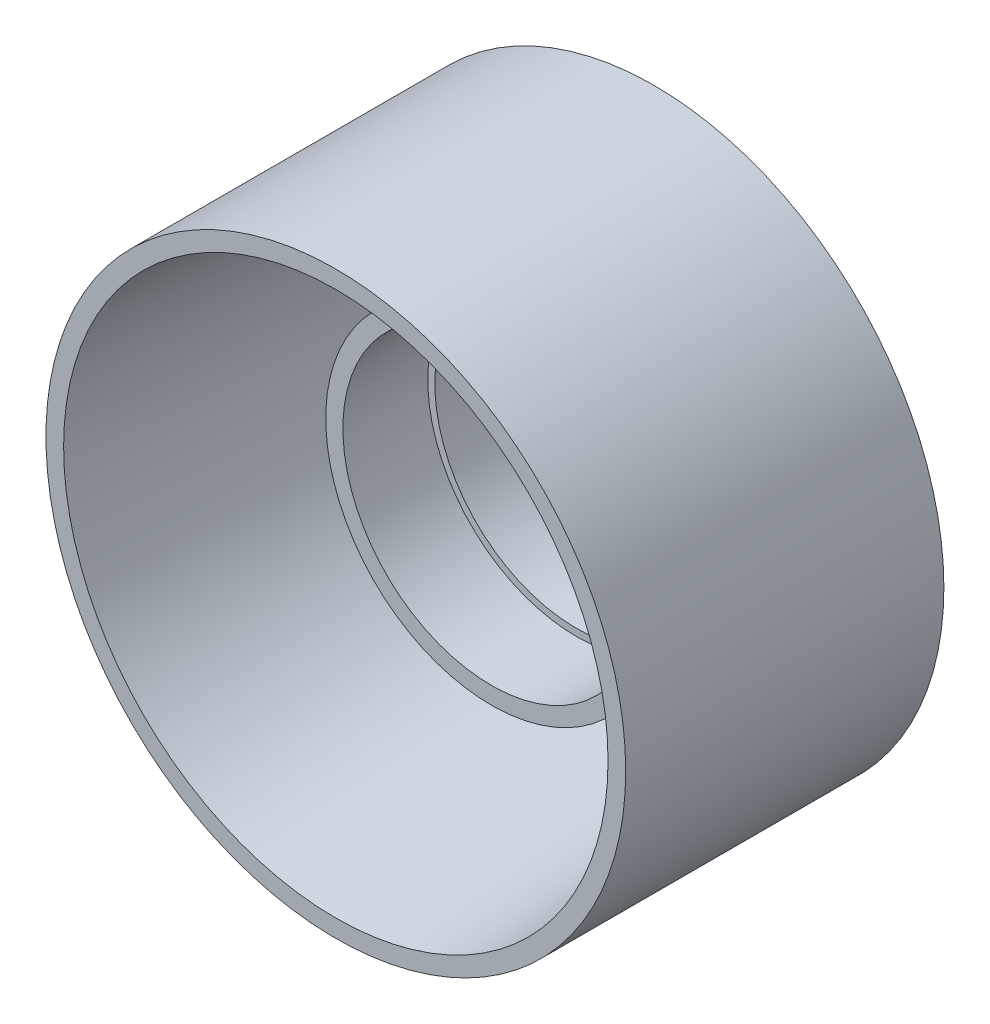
ISO-10303-21;
HEADER;
FILE_DESCRIPTION(('STEP AP214'),'2;1');
FILE_NAME('part.step','',(''),(''),'','','');
FILE_SCHEMA(('AUTOMOTIVE_DESIGN { 1 0 10303 214 1 1 1 1 }'));
ENDSEC;
DATA;
#1=APPLICATION_CONTEXT('core data for automotive mechanical design processes');
#2=APPLICATION_PROTOCOL_DEFINITION('international standard','automotive_design',2000,#1);
#3=PRODUCT_CONTEXT('',#1,'mechanical');
#4=PRODUCT('Part','Part','',(#3));
#5=PRODUCT_RELATED_PRODUCT_CATEGORY('part','',(#4));
#6=PRODUCT_DEFINITION_FORMATION('','',#4);
#7=PRODUCT_DEFINITION_CONTEXT('part definition',#1,'design');
#8=PRODUCT_DEFINITION('design','',#6,#7);
#9=PRODUCT_DEFINITION_SHAPE('','',#8);
#10=(LENGTH_UNIT() NAMED_UNIT(*) SI_UNIT(.MILLI.,.METRE.));
#11=(NAMED_UNIT(*) PLANE_ANGLE_UNIT() SI_UNIT($,.RADIAN.));
#12=(NAMED_UNIT(*) SI_UNIT($,.STERADIAN.) SOLID_ANGLE_UNIT());
#13=UNCERTAINTY_MEASURE_WITH_UNIT(LENGTH_MEASURE(1.E-05),#10,'distance_accuracy_value','');
#14=(GEOMETRIC_REPRESENTATION_CONTEXT(3) GLOBAL_UNCERTAINTY_ASSIGNED_CONTEXT((#13)) GLOBAL_UNIT_ASSIGNED_CONTEXT((#10,
#11,#12)) REPRESENTATION_CONTEXT('',''));
#15=CARTESIAN_POINT('',(0.,0.,0.));
#16=DIRECTION('',(0.,0.,1.));
#17=DIRECTION('',(1.,0.,0.));
#18=AXIS2_PLACEMENT_3D('',#15,#16,#17);
#19=CARTESIAN_POINT('',(0.,0.,5.));
#20=DIRECTION('',(0.,0.,1.));
#21=DIRECTION('',(1.,0.,0.));
#22=AXIS2_PLACEMENT_3D('',#19,#20,#21);
#23=PLANE('',#22);
#24=CARTESIAN_POINT('',(0.,0.,5.));
#25=DIRECTION('',(0.,0.,1.));
#26=DIRECTION('',(1.,0.,0.));
#27=AXIS2_PLACEMENT_3D('',#24,#25,#26);
#28=CIRCLE('',#27,35.0004534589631);
#29=CARTESIAN_POINT('',(35.0004534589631,0.,5.));
#30=VERTEX_POINT('',#29);
#31=EDGE_CURVE('E26',#30,#30,#28,.T.);
#32=ORIENTED_EDGE('',*,*,#31,.T.);
#33=EDGE_LOOP('',(#32));
#34=FACE_BOUND('',#33,.T.);
#35=CARTESIAN_POINT('',(0.,0.,5.));
#36=DIRECTION('',(0.,0.,1.));
#37=DIRECTION('',(1.,0.,0.));
#38=AXIS2_PLACEMENT_3D('',#35,#36,#37);
#39=CIRCLE('',#38,25.);
#40=CARTESIAN_POINT('',(25.,0.,5.));
#41=VERTEX_POINT('',#40);
#42=EDGE_CURVE('E38',#41,#41,#39,.T.);
#43=ORIENTED_EDGE('',*,*,#42,.F.);
#44=EDGE_LOOP('',(#43));
#45=FACE_BOUND('',#44,.T.);
#46=ADVANCED_FACE('F15',(#34,#45),#23,.T.);
#47=CARTESIAN_POINT('',(0.,0.,45.));
#48=DIRECTION('',(0.,0.,-1.));
#49=DIRECTION('',(-1.,0.,0.));
#50=AXIS2_PLACEMENT_3D('',#47,#48,#49);
#51=CYLINDRICAL_SURFACE('',#50,41.);
#52=CARTESIAN_POINT('',(0.,0.,45.));
#53=DIRECTION('',(0.,0.,1.));
#54=DIRECTION('',(1.,0.,0.));
#55=AXIS2_PLACEMENT_3D('',#52,#53,#54);
#56=CIRCLE('',#55,41.);
#57=CARTESIAN_POINT('',(41.,0.,45.));
#58=VERTEX_POINT('',#57);
#59=EDGE_CURVE('E10',#58,#58,#56,.T.);
#60=ORIENTED_EDGE('',*,*,#59,.F.);
#61=EDGE_LOOP('',(#60));
#62=FACE_BOUND('',#61,.T.);
#63=CARTESIAN_POINT('',(0.,0.,0.));
#64=DIRECTION('',(0.,0.,1.));
#65=DIRECTION('',(1.,0.,0.));
#66=AXIS2_PLACEMENT_3D('',#63,#64,#65);
#67=CIRCLE('',#66,41.);
#68=CARTESIAN_POINT('',(41.,0.,0.));
#69=VERTEX_POINT('',#68);
#70=EDGE_CURVE('E22',#69,#69,#67,.T.);
#71=ORIENTED_EDGE('',*,*,#70,.T.);
#72=EDGE_LOOP('',(#71));
#73=FACE_BOUND('',#72,.T.);
#74=ADVANCED_FACE('F17',(#62,#73),#51,.T.);
#75=CARTESIAN_POINT('',(0.,0.,45.));
#76=DIRECTION('',(0.,0.,1.));
#77=DIRECTION('',(1.,0.,0.));
#78=AXIS2_PLACEMENT_3D('',#75,#76,#77);
#79=PLANE('',#78);
#80=CARTESIAN_POINT('',(0.,0.,45.));
#81=DIRECTION('',(0.,0.,1.));
#82=DIRECTION('',(1.,0.,0.));
#83=AXIS2_PLACEMENT_3D('',#80,#81,#82);
#84=CIRCLE('',#83,38.5);
#85=CARTESIAN_POINT('',(38.5,0.,45.));
#86=VERTEX_POINT('',#85);
#87=EDGE_CURVE('E30',#86,#86,#84,.T.);
#88=ORIENTED_EDGE('',*,*,#87,.F.);
#89=EDGE_LOOP('',(#88));
#90=FACE_BOUND('',#89,.T.);
#91=ORIENTED_EDGE('',*,*,#59,.T.);
#92=EDGE_LOOP('',(#91));
#93=FACE_BOUND('',#92,.T.);
#94=ADVANCED_FACE('F106',(#90,#93),#79,.T.);
#95=CARTESIAN_POINT('',(0.,0.,0.));
#96=DIRECTION('',(0.,0.,1.));
#97=DIRECTION('',(1.,0.,0.));
#98=AXIS2_PLACEMENT_3D('',#95,#96,#97);
#99=PLANE('',#98);
#100=CARTESIAN_POINT('',(0.,0.,0.));
#101=DIRECTION('',(0.,0.,1.));
#102=DIRECTION('',(1.,0.,0.));
#103=AXIS2_PLACEMENT_3D('',#100,#101,#102);
#104=CIRCLE('',#103,15.5);
#105=CARTESIAN_POINT('',(15.5,0.,0.));
#106=VERTEX_POINT('',#105);
#107=EDGE_CURVE('E53',#106,#106,#104,.T.);
#108=ORIENTED_EDGE('',*,*,#107,.T.);
#109=EDGE_LOOP('',(#108));
#110=FACE_BOUND('',#109,.T.);
#111=ORIENTED_EDGE('',*,*,#70,.F.);
#112=EDGE_LOOP('',(#111));
#113=FACE_BOUND('',#112,.T.);
#114=ADVANCED_FACE('F111',(#110,#113),#99,.F.);
#115=CARTESIAN_POINT('',(0.,0.,45.));
#116=DIRECTION('',(0.,0.,1.));
#117=DIRECTION('',(1.,0.,0.));
#118=AXIS2_PLACEMENT_3D('',#115,#116,#117);
#119=CONICAL_SURFACE('',#118,38.5,0.0872664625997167);
#120=ORIENTED_EDGE('',*,*,#31,.F.);
#121=EDGE_LOOP('',(#120));
#122=FACE_BOUND('',#121,.T.);
#123=ORIENTED_EDGE('',*,*,#87,.T.);
#124=EDGE_LOOP('',(#123));
#125=FACE_BOUND('',#124,.T.);
#126=ADVANCED_FACE('F95',(#122,#125),#119,.F.);
#127=CARTESIAN_POINT('',(0.,0.,5.));
#128=DIRECTION('',(0.,0.,-1.));
#129=DIRECTION('',(1.,0.,0.));
#130=AXIS2_PLACEMENT_3D('',#127,#128,#129);
#131=CONICAL_SURFACE('',#130,25.,0.0872664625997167);
#132=CARTESIAN_POINT('',(0.,0.,23.));
#133=DIRECTION('',(0.,0.,1.));
#134=DIRECTION('',(1.,0.,0.));
#135=AXIS2_PLACEMENT_3D('',#132,#133,#134);
#136=CIRCLE('',#135,23.4252040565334);
#137=CARTESIAN_POINT('',(23.4252040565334,0.,23.));
#138=VERTEX_POINT('',#137);
#139=EDGE_CURVE('E35',#138,#138,#136,.T.);
#140=ORIENTED_EDGE('',*,*,#139,.F.);
#141=EDGE_LOOP('',(#140));
#142=FACE_BOUND('',#141,.T.);
#143=ORIENTED_EDGE('',*,*,#42,.T.);
#144=EDGE_LOOP('',(#143));
#145=FACE_BOUND('',#144,.T.);
#146=ADVANCED_FACE('F89',(#142,#145),#131,.T.);
#147=CARTESIAN_POINT('',(0.,0.,23.));
#148=DIRECTION('',(0.,0.,1.));
#149=DIRECTION('',(1.,0.,0.));
#150=AXIS2_PLACEMENT_3D('',#147,#148,#149);
#151=PLANE('',#150);
#152=CARTESIAN_POINT('',(0.,0.,23.));
#153=DIRECTION('',(0.,0.,1.));
#154=DIRECTION('',(1.,0.,0.));
#155=AXIS2_PLACEMENT_3D('',#152,#153,#154);
#156=CIRCLE('',#155,21.);
#157=CARTESIAN_POINT('',(21.,0.,23.));
#158=VERTEX_POINT('',#157);
#159=EDGE_CURVE('E44',#158,#158,#156,.T.);
#160=ORIENTED_EDGE('',*,*,#159,.F.);
#161=EDGE_LOOP('',(#160));
#162=FACE_BOUND('',#161,.T.);
#163=ORIENTED_EDGE('',*,*,#139,.T.);
#164=EDGE_LOOP('',(#163));
#165=FACE_BOUND('',#164,.T.);
#166=ADVANCED_FACE('F83',(#162,#165),#151,.T.);
#167=CARTESIAN_POINT('',(0.,0.,11.));
#168=DIRECTION('',(0.,0.,1.));
#169=DIRECTION('',(1.,0.,0.));
#170=AXIS2_PLACEMENT_3D('',#167,#168,#169);
#171=CYLINDRICAL_SURFACE('',#170,21.);
#172=CARTESIAN_POINT('',(0.,0.,11.));
#173=DIRECTION('',(0.,0.,1.));
#174=DIRECTION('',(1.,0.,0.));
#175=AXIS2_PLACEMENT_3D('',#172,#173,#174);
#176=CIRCLE('',#175,21.);
#177=CARTESIAN_POINT('',(21.,0.,11.));
#178=VERTEX_POINT('',#177);
#179=EDGE_CURVE('E41',#178,#178,#176,.T.);
#180=ORIENTED_EDGE('',*,*,#179,.F.);
#181=EDGE_LOOP('',(#180));
#182=FACE_BOUND('',#181,.T.);
#183=ORIENTED_EDGE('',*,*,#159,.T.);
#184=EDGE_LOOP('',(#183));
#185=FACE_BOUND('',#184,.T.);
#186=ADVANCED_FACE('F77',(#182,#185),#171,.F.);
#187=CARTESIAN_POINT('',(0.,0.,11.));
#188=DIRECTION('',(0.,0.,1.));
#189=DIRECTION('',(1.,0.,0.));
#190=AXIS2_PLACEMENT_3D('',#187,#188,#189);
#191=PLANE('',#190);
#192=CARTESIAN_POINT('',(0.,0.,11.));
#193=DIRECTION('',(0.,0.,1.));
#194=DIRECTION('',(1.,0.,0.));
#195=AXIS2_PLACEMENT_3D('',#192,#193,#194);
#196=CIRCLE('',#195,20.);
#197=CARTESIAN_POINT('',(20.,0.,11.));
#198=VERTEX_POINT('',#197);
#199=EDGE_CURVE('E50',#198,#198,#196,.T.);
#200=ORIENTED_EDGE('',*,*,#199,.F.);
#201=EDGE_LOOP('',(#200));
#202=FACE_BOUND('',#201,.T.);
#203=ORIENTED_EDGE('',*,*,#179,.T.);
#204=EDGE_LOOP('',(#203));
#205=FACE_BOUND('',#204,.T.);
#206=ADVANCED_FACE('F71',(#202,#205),#191,.T.);
#207=CARTESIAN_POINT('',(0.,0.,1.));
#208=DIRECTION('',(0.,0.,1.));
#209=DIRECTION('',(1.,0.,0.));
#210=AXIS2_PLACEMENT_3D('',#207,#208,#209);
#211=CYLINDRICAL_SURFACE('',#210,20.);
#212=CARTESIAN_POINT('',(0.,0.,1.));
#213=DIRECTION('',(0.,0.,1.));
#214=DIRECTION('',(1.,0.,0.));
#215=AXIS2_PLACEMENT_3D('',#212,#213,#214);
#216=CIRCLE('',#215,20.);
#217=CARTESIAN_POINT('',(20.,0.,1.));
#218=VERTEX_POINT('',#217);
#219=EDGE_CURVE('E47',#218,#218,#216,.T.);
#220=ORIENTED_EDGE('',*,*,#219,.F.);
#221=EDGE_LOOP('',(#220));
#222=FACE_BOUND('',#221,.T.);
#223=ORIENTED_EDGE('',*,*,#199,.T.);
#224=EDGE_LOOP('',(#223));
#225=FACE_BOUND('',#224,.T.);
#226=ADVANCED_FACE('F65',(#222,#225),#211,.F.);
#227=CARTESIAN_POINT('',(0.,0.,1.));
#228=DIRECTION('',(0.,0.,1.));
#229=DIRECTION('',(1.,0.,0.));
#230=AXIS2_PLACEMENT_3D('',#227,#228,#229);
#231=PLANE('',#230);
#232=CARTESIAN_POINT('',(0.,0.,1.));
#233=DIRECTION('',(0.,0.,1.));
#234=DIRECTION('',(1.,0.,0.));
#235=AXIS2_PLACEMENT_3D('',#232,#233,#234);
#236=CIRCLE('',#235,15.5);
#237=CARTESIAN_POINT('',(15.5,0.,1.));
#238=VERTEX_POINT('',#237);
#239=EDGE_CURVE('E56',#238,#238,#236,.T.);
#240=ORIENTED_EDGE('',*,*,#239,.F.);
#241=EDGE_LOOP('',(#240));
#242=FACE_BOUND('',#241,.T.);
#243=ORIENTED_EDGE('',*,*,#219,.T.);
#244=EDGE_LOOP('',(#243));
#245=FACE_BOUND('',#244,.T.);
#246=ADVANCED_FACE('F62',(#242,#245),#231,.T.);
#247=CARTESIAN_POINT('',(0.,0.,0.));
#248=DIRECTION('',(0.,0.,1.));
#249=DIRECTION('',(1.,0.,0.));
#250=AXIS2_PLACEMENT_3D('',#247,#248,#249);
#251=CYLINDRICAL_SURFACE('',#250,15.5);
#252=ORIENTED_EDGE('',*,*,#107,.F.);
#253=EDGE_LOOP('',(#252));
#254=FACE_BOUND('',#253,.T.);
#255=ORIENTED_EDGE('',*,*,#239,.T.);
#256=EDGE_LOOP('',(#255));
#257=FACE_BOUND('',#256,.T.);
#258=ADVANCED_FACE('F60',(#254,#257),#251,.F.);
#259=CLOSED_SHELL('',(#46,#74,#94,#114,#126,#146,#166,#186,#206,#226,#246,#258));
#260=MANIFOLD_SOLID_BREP('B1',#259);
#261=ADVANCED_BREP_SHAPE_REPRESENTATION('',(#18,#260),#14);
#262=SHAPE_DEFINITION_REPRESENTATION(#9,#261);
ENDSEC;
END-ISO-10303-21;
